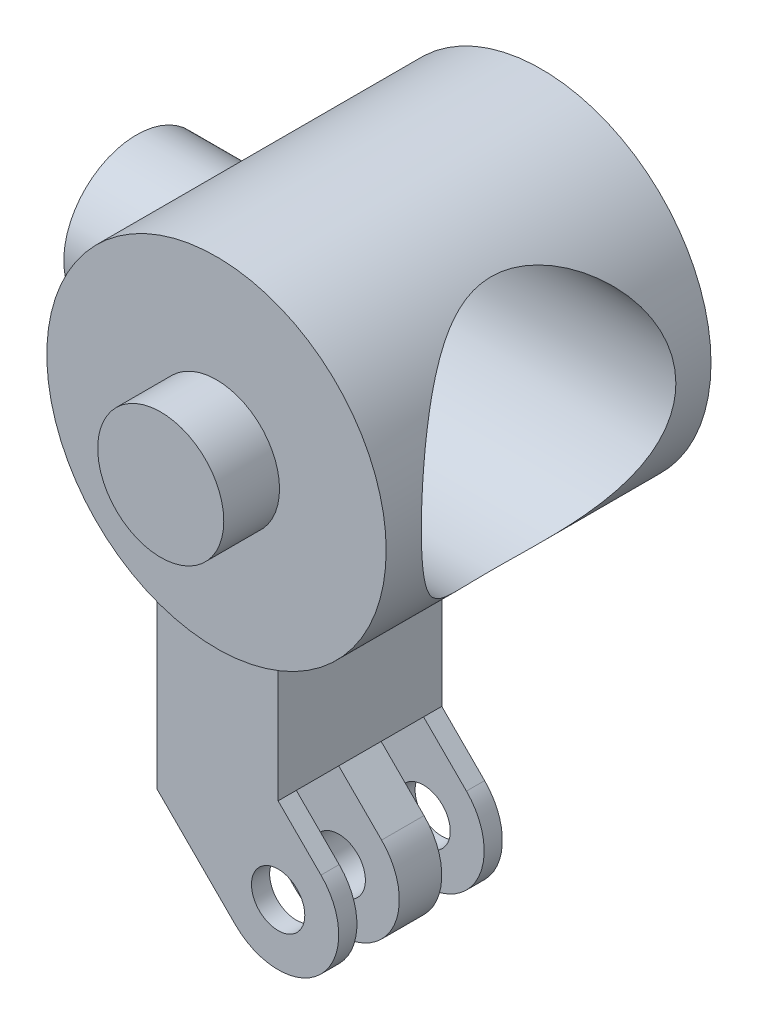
ISO-10303-21;
HEADER;
FILE_DESCRIPTION(('STEP AP214'),'2;1');
FILE_NAME('part.step','',(''),(''),'','','');
FILE_SCHEMA(('AUTOMOTIVE_DESIGN { 1 0 10303 214 1 1 1 1 }'));
ENDSEC;
DATA;
#1=APPLICATION_CONTEXT('core data for automotive mechanical design processes');
#2=APPLICATION_PROTOCOL_DEFINITION('international standard','automotive_design',2000,#1);
#3=PRODUCT_CONTEXT('',#1,'mechanical');
#4=PRODUCT('Part','Part','',(#3));
#5=PRODUCT_RELATED_PRODUCT_CATEGORY('part','',(#4));
#6=PRODUCT_DEFINITION_FORMATION('','',#4);
#7=PRODUCT_DEFINITION_CONTEXT('part definition',#1,'design');
#8=PRODUCT_DEFINITION('design','',#6,#7);
#9=PRODUCT_DEFINITION_SHAPE('','',#8);
#10=(LENGTH_UNIT() NAMED_UNIT(*) SI_UNIT(.MILLI.,.METRE.));
#11=(NAMED_UNIT(*) PLANE_ANGLE_UNIT() SI_UNIT($,.RADIAN.));
#12=(NAMED_UNIT(*) SI_UNIT($,.STERADIAN.) SOLID_ANGLE_UNIT());
#13=UNCERTAINTY_MEASURE_WITH_UNIT(LENGTH_MEASURE(1.E-05),#10,'distance_accuracy_value','');
#14=(GEOMETRIC_REPRESENTATION_CONTEXT(3) GLOBAL_UNCERTAINTY_ASSIGNED_CONTEXT((#13)) GLOBAL_UNIT_ASSIGNED_CONTEXT((#10,
#11,#12)) REPRESENTATION_CONTEXT('',''));
#15=CARTESIAN_POINT('',(0.,0.,0.));
#16=DIRECTION('',(0.,0.,1.));
#17=DIRECTION('',(1.,0.,0.));
#18=AXIS2_PLACEMENT_3D('',#15,#16,#17);
#19=CARTESIAN_POINT('',(-28.5875999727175,51.1546126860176,-23.4989898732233));
#20=DIRECTION('',(0.,0.,1.));
#21=DIRECTION('',(1.,0.,0.));
#22=AXIS2_PLACEMENT_3D('',#19,#20,#21);
#23=CYLINDRICAL_SURFACE('',#22,7.);
#24=CARTESIAN_POINT('',(-21.5875999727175,51.1546126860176,10.25));
#25=CARTESIAN_POINT('',(-21.5876011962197,51.0264088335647,10.2499987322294));
#26=CARTESIAN_POINT('',(-21.591130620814,50.8981728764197,10.2452953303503));
#27=CARTESIAN_POINT('',(-21.605168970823,50.6427134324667,10.2265552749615));
#28=CARTESIAN_POINT('',(-21.6156820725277,50.5154905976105,10.2125130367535));
#29=CARTESIAN_POINT('',(-21.6434657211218,50.2628877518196,10.1752926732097));
#30=CARTESIAN_POINT('',(-21.6607491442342,50.1375117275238,10.1520971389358));
#31=CARTESIAN_POINT('',(-21.7016847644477,49.8897201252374,10.0969274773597));
#32=CARTESIAN_POINT('',(-21.7253398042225,49.7673058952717,10.0649494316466));
#33=CARTESIAN_POINT('',(-21.7783333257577,49.527063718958,9.99291542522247));
#34=CARTESIAN_POINT('',(-21.8076333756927,49.4092108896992,9.95291401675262));
#35=CARTESIAN_POINT('',(-21.8714395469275,49.1778436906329,9.86520416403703));
#36=CARTESIAN_POINT('',(-21.905947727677,49.0643310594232,9.81749267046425));
#37=CARTESIAN_POINT('',(-22.0163020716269,48.7312658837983,9.66364649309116));
#38=CARTESIAN_POINT('',(-22.0990495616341,48.5188731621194,9.54670451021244));
#39=CARTESIAN_POINT('',(-22.2858703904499,48.0974464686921,9.2760694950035));
#40=CARTESIAN_POINT('',(-22.3912089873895,47.890544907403,9.11997600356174));
#41=CARTESIAN_POINT('',(-22.6107695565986,47.5040090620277,8.78175289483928));
#42=CARTESIAN_POINT('',(-22.7250051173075,47.3244177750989,8.59958308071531));
#43=CARTESIAN_POINT('',(-22.908986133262,47.059730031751,8.28906252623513));
#44=CARTESIAN_POINT('',(-22.9783440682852,46.9654717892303,8.16814667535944));
#45=CARTESIAN_POINT('',(-23.1157543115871,46.7875167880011,7.91796964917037));
#46=CARTESIAN_POINT('',(-23.1838062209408,46.7038232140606,7.78870597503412));
#47=CARTESIAN_POINT('',(-23.3164288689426,46.5475257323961,7.52212020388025));
#48=CARTESIAN_POINT('',(-23.3810030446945,46.4749107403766,7.38480635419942));
#49=CARTESIAN_POINT('',(-23.5042350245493,46.341333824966,7.10220995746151));
#50=CARTESIAN_POINT('',(-23.5628961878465,46.2803652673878,6.95693200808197));
#51=CARTESIAN_POINT('',(-23.688398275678,46.1538065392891,6.61178251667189));
#52=CARTESIAN_POINT('',(-23.7520888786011,46.0927000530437,6.40900968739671));
#53=CARTESIAN_POINT('',(-23.8305210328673,46.0192954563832,6.09657119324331));
#54=CARTESIAN_POINT('',(-23.8538061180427,45.9978767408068,5.9911071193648));
#55=CARTESIAN_POINT('',(-23.8938122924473,45.9614352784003,5.77787383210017));
#56=CARTESIAN_POINT('',(-23.9105367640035,45.9464092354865,5.67010583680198));
#57=CARTESIAN_POINT('',(-23.9368035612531,45.9229389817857,5.45193072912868));
#58=CARTESIAN_POINT('',(-23.9462764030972,45.9145584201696,5.3415082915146));
#59=CARTESIAN_POINT('',(-23.9573028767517,45.9048123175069,5.11995649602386));
#60=CARTESIAN_POINT('',(-23.9588567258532,45.9034465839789,5.00882715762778));
#61=CARTESIAN_POINT('',(-23.953959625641,45.9077670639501,4.78684506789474));
#62=CARTESIAN_POINT('',(-23.9475060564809,45.9134555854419,4.67599241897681));
#63=CARTESIAN_POINT('',(-23.9269346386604,45.9317420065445,4.45560524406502));
#64=CARTESIAN_POINT('',(-23.9128167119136,45.9443399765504,4.34607073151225));
#65=CARTESIAN_POINT('',(-23.8637130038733,45.9886922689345,4.04397521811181));
#66=CARTESIAN_POINT('',(-23.8210449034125,46.0277215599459,3.85367609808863));
#67=CARTESIAN_POINT('',(-23.7186077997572,46.1249183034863,3.48291047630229));
#68=CARTESIAN_POINT('',(-23.6588223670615,46.1831041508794,3.30245362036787));
#69=CARTESIAN_POINT('',(-23.5399058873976,46.3041910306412,2.98528134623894));
#70=CARTESIAN_POINT('',(-23.4827354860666,46.3641849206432,2.84668835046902));
#71=CARTESIAN_POINT('',(-23.363204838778,46.4948343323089,2.57689336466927));
#72=CARTESIAN_POINT('',(-23.3008419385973,46.5654953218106,2.44569521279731));
#73=CARTESIAN_POINT('',(-23.172975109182,46.7170803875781,2.19057511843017));
#74=CARTESIAN_POINT('',(-23.1074649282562,46.7980254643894,2.0666688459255));
#75=CARTESIAN_POINT('',(-22.9752694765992,46.969700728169,1.8265487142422));
#76=CARTESIAN_POINT('',(-22.9085843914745,47.0604293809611,1.71033365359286));
#77=CARTESIAN_POINT('',(-22.773958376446,47.253870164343,1.48296566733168));
#78=CARTESIAN_POINT('',(-22.7060279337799,47.356825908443,1.3720130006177));
#79=CARTESIAN_POINT('',(-22.5721726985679,47.5726022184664,1.15881083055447));
#80=CARTESIAN_POINT('',(-22.5062487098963,47.6854266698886,1.05656478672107));
#81=CARTESIAN_POINT('',(-22.3140072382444,48.0379849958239,0.764185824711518));
#82=CARTESIAN_POINT('',(-22.1928024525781,48.2923804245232,0.587730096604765));
#83=CARTESIAN_POINT('',(-21.9977858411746,48.7820270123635,0.310035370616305));
#84=CARTESIAN_POINT('',(-21.9193442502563,49.0108857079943,0.200808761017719));
#85=CARTESIAN_POINT('',(-21.8182195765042,49.3683087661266,0.0615778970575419));
#86=CARTESIAN_POINT('',(-21.7872617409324,49.4898390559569,0.0192613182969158));
#87=CARTESIAN_POINT('',(-21.7314900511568,49.7369483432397,-0.0566203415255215));
#88=CARTESIAN_POINT('',(-21.7066735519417,49.8625255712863,-0.090189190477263));
#89=CARTESIAN_POINT('',(-21.6636006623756,50.117745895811,-0.148266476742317));
#90=CARTESIAN_POINT('',(-21.6453877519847,50.2474100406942,-0.172714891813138));
#91=CARTESIAN_POINT('',(-21.6161921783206,50.5090184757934,-0.211832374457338));
#92=CARTESIAN_POINT('',(-21.6052095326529,50.6409627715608,-0.226501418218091));
#93=CARTESIAN_POINT('',(-21.5907600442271,50.9059514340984,-0.245789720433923));
#94=CARTESIAN_POINT('',(-21.587290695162,51.0389954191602,-0.250412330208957));
#95=CARTESIAN_POINT('',(-21.5879524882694,51.305024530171,-0.24953001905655));
#96=CARTESIAN_POINT('',(-21.5920830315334,51.4380096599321,-0.244025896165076));
#97=CARTESIAN_POINT('',(-21.6070368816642,51.689362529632,-0.224059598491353));
#98=CARTESIAN_POINT('',(-21.6171428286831,51.8078512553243,-0.210557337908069));
#99=CARTESIAN_POINT('',(-21.6431998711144,52.0430445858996,-0.175647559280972));
#100=CARTESIAN_POINT('',(-21.6591529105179,52.1597485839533,-0.15423741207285));
#101=CARTESIAN_POINT('',(-21.6965853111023,52.3905652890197,-0.10380929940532));
#102=CARTESIAN_POINT('',(-21.7180633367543,52.5046786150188,-0.0747931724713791));
#103=CARTESIAN_POINT('',(-21.7661422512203,52.7297259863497,-0.00951773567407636));
#104=CARTESIAN_POINT('',(-21.7927451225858,52.8406587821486,0.0267443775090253));
#105=CARTESIAN_POINT('',(-21.8815843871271,53.175440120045,0.148573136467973));
#106=CARTESIAN_POINT('',(-21.9515212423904,53.3932782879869,0.245419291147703));
#107=CARTESIAN_POINT('',(-22.106762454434,53.8094640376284,0.464613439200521));
#108=CARTESIAN_POINT('',(-22.1920689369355,54.0078089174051,0.586964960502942));
#109=CARTESIAN_POINT('',(-22.388422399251,54.4148862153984,0.876234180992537));
#110=CARTESIAN_POINT('',(-22.501388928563,54.6198216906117,1.04718217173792));
#111=CARTESIAN_POINT('',(-22.7342593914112,55.0001565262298,1.41604839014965));
#112=CARTESIAN_POINT('',(-22.8541783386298,55.1754885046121,1.61402633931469));
#113=CARTESIAN_POINT('',(-23.0438808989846,55.4302737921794,1.94944272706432));
#114=CARTESIAN_POINT('',(-23.1143214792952,55.5198205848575,2.07897278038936));
#115=CARTESIAN_POINT('',(-23.2524168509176,55.6875595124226,2.3467252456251));
#116=CARTESIAN_POINT('',(-23.3200706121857,55.7657474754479,2.48495082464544));
#117=CARTESIAN_POINT('',(-23.4498889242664,55.9099592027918,2.7696273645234));
#118=CARTESIAN_POINT('',(-23.512066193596,55.9760115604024,2.91605790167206));
#119=CARTESIAN_POINT('',(-23.6280696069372,56.0952570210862,3.21709424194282));
#120=CARTESIAN_POINT('',(-23.6819026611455,56.1484607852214,3.37169313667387));
#121=CARTESIAN_POINT('',(-23.7884298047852,56.2511455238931,3.7239145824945));
#122=CARTESIAN_POINT('',(-23.8382376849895,56.2971995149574,3.92348927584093));
#123=CARTESIAN_POINT('',(-23.894830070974,56.3486998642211,4.22887031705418));
#124=CARTESIAN_POINT('',(-23.9106706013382,56.3629335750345,4.33160974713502));
#125=CARTESIAN_POINT('',(-23.9357257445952,56.3853254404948,4.53853335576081));
#126=CARTESIAN_POINT('',(-23.9449433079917,56.393486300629,4.64271686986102));
#127=CARTESIAN_POINT('',(-23.9563699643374,56.4035904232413,4.85233325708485));
#128=CARTESIAN_POINT('',(-23.9585410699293,56.4054999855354,4.95776983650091));
#129=CARTESIAN_POINT('',(-23.955668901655,56.4029665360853,5.16846519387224));
#130=CARTESIAN_POINT('',(-23.9506257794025,56.3985236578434,5.27372397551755));
#131=CARTESIAN_POINT('',(-23.9335516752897,56.3833757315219,5.48330900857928));
#132=CARTESIAN_POINT('',(-23.9215142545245,56.372664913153,5.58763431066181));
#133=CARTESIAN_POINT('',(-23.8909688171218,56.3451882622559,5.79456222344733));
#134=CARTESIAN_POINT('',(-23.8724574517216,56.3284192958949,5.89716391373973));
#135=CARTESIAN_POINT('',(-23.8250310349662,56.2848356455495,6.12211300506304));
#136=CARTESIAN_POINT('',(-23.7947285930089,56.2566289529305,6.24389829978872));
#137=CARTESIAN_POINT('',(-23.7270747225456,56.1922183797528,6.48338359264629));
#138=CARTESIAN_POINT('',(-23.6897179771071,56.1560084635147,6.60108042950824));
#139=CARTESIAN_POINT('',(-23.6093869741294,56.0760566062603,6.83217639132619));
#140=CARTESIAN_POINT('',(-23.5664016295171,56.0322997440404,6.94556644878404));
#141=CARTESIAN_POINT('',(-23.4762720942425,55.9377699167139,7.16759384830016));
#142=CARTESIAN_POINT('',(-23.4291291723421,55.8869990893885,7.27623262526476));
#143=CARTESIAN_POINT('',(-23.3150072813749,55.7599747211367,7.5256599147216));
#144=CARTESIAN_POINT('',(-23.2468243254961,55.6809939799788,7.66451427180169));
#145=CARTESIAN_POINT('',(-23.1076583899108,55.511478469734,7.93351407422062));
#146=CARTESIAN_POINT('',(-23.0366745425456,55.4209401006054,8.06365678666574));
#147=CARTESIAN_POINT('',(-22.8940192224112,55.2286138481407,8.31512987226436));
#148=CARTESIAN_POINT('',(-22.8223472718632,55.1268175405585,8.4364535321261));
#149=CARTESIAN_POINT('',(-22.6802816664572,54.9122905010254,8.66980525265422));
#150=CARTESIAN_POINT('',(-22.6098878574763,54.7995610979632,8.78183443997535));
#151=CARTESIAN_POINT('',(-22.4715431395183,54.5623767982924,8.99693460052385));
#152=CARTESIAN_POINT('',(-22.4036177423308,54.437831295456,9.09992234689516));
#153=CARTESIAN_POINT('',(-22.2725625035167,54.1780973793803,9.29504599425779));
#154=CARTESIAN_POINT('',(-22.2094332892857,54.0429075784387,9.38718047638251));
#155=CARTESIAN_POINT('',(-22.0898061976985,53.7626476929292,9.55934721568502));
#156=CARTESIAN_POINT('',(-22.0332957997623,53.6175971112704,9.63940240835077));
#157=CARTESIAN_POINT('',(-21.9284686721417,53.318195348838,9.78635363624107));
#158=CARTESIAN_POINT('',(-21.8801477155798,53.163849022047,9.85325646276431));
#159=CARTESIAN_POINT('',(-21.8060242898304,52.8934995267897,9.95510849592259));
#160=CARTESIAN_POINT('',(-21.7777725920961,52.779515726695,9.99367609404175));
#161=CARTESIAN_POINT('',(-21.7266721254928,52.5480620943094,10.063139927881));
#162=CARTESIAN_POINT('',(-21.7038220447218,52.4305931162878,10.0940380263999));
#163=CARTESIAN_POINT('',(-21.6640202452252,52.19312456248,10.1476964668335));
#164=CARTESIAN_POINT('',(-21.6470548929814,52.0731315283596,10.1704756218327));
#165=CARTESIAN_POINT('',(-21.619310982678,51.8311909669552,10.207658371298));
#166=CARTESIAN_POINT('',(-21.608529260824,51.7092444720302,10.2220662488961));
#167=CARTESIAN_POINT('',(-21.5965127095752,51.5149978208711,10.2381117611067));
#168=CARTESIAN_POINT('',(-21.5931734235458,51.4430441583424,10.2425668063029));
#169=CARTESIAN_POINT('',(-21.5887165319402,51.2989346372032,10.2485115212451));
#170=CARTESIAN_POINT('',(-21.587599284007,51.2267787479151,10.2500007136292));
#171=CARTESIAN_POINT('',(-21.5875999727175,51.1546126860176,10.25));
#172=B_SPLINE_CURVE_WITH_KNOTS('',3,(#24,#25,#26,#27,#28,#29,#30,#31,#32,#33,#34,#35,#36,#37,
#38,#39,#40,#41,#42,#43,#44,#45,#46,#47,#48,#49,#50,#51,#52,#53,#54,#55,#56,#57,#58,#59,#60,#61,
#62,#63,#64,#65,#66,#67,#68,#69,#70,#71,#72,#73,#74,#75,#76,#77,#78,#79,#80,#81,#82,#83,#84,#85,
#86,#87,#88,#89,#90,#91,#92,#93,#94,#95,#96,#97,#98,#99,#100,#101,#102,#103,#104,#105,#106,#107,
#108,#109,#110,#111,#112,#113,#114,#115,#116,#117,#118,#119,#120,#121,#122,#123,#124,#125,#126,
#127,#128,#129,#130,#131,#132,#133,#134,#135,#136,#137,#138,#139,#140,#141,#142,#143,#144,#145,
#146,#147,#148,#149,#150,#151,#152,#153,#154,#155,#156,#157,#158,#159,#160,#161,#162,#163,#164,
#165,#166,#167,#168,#169,#170,#171),.UNSPECIFIED.,.T.,.F.,(4,2,2,2,2,2,2,2,2,2,2,2,2,2,2,2,2,2,
2,2,2,2,2,2,2,2,2,2,2,2,2,2,2,2,2,2,2,2,2,2,2,2,2,2,2,2,2,2,2,2,2,2,2,2,2,2,2,2,2,2,2,2,2,2,2,2,
2,2,2,2,2,2,2,4),(0.,0.38453366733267,0.769297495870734,1.15479667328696,1.54046812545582,
1.9236011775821,2.306886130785,3.07246235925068,3.90893405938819,4.74670935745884,
5.25106429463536,5.75557091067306,6.25956940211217,6.76327993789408,7.42400799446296,
7.75399907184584,8.08381979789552,8.41676256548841,8.74969619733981,9.08273878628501,
9.4157847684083,10.0100461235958,10.6048797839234,11.0886886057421,11.572746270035,
12.0578087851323,12.5427953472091,13.0399543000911,13.5373098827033,14.529097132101,
15.3219816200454,15.7186301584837,16.1151075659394,16.5141500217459,16.9131934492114,
17.312103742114,17.7109826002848,18.0696141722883,18.4283650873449,18.7870293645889,
19.1458326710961,19.8880454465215,20.6303609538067,21.4966434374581,22.3648718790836,
22.88187214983,23.399061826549,23.9150168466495,24.4305422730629,25.0601070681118,
25.3745481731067,25.6888491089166,26.0048416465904,26.3208275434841,26.6371047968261,
26.9535458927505,27.3388522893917,27.7244502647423,28.1108195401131,28.4970713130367,
29.0174330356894,29.5379572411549,30.0588736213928,30.5797267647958,31.1049585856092,
31.6302589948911,32.154549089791,32.6785677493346,33.0490143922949,33.4193709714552,
33.7888636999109,34.1581672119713,34.3745867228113,34.5910410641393),.UNSPECIFIED.);
#173=CARTESIAN_POINT('',(-21.5875999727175,51.1546126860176,10.25));
#174=VERTEX_POINT('',#173);
#175=EDGE_CURVE('E13',#174,#174,#172,.T.);
#176=ORIENTED_EDGE('',*,*,#175,.F.);
#177=EDGE_LOOP('',(#176));
#178=FACE_BOUND('',#177,.T.);
#179=CARTESIAN_POINT('',(-35.5875999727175,51.1546126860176,2.));
#180=CARTESIAN_POINT('',(-35.5875940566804,51.3148944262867,2.00000746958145));
#181=CARTESIAN_POINT('',(-35.5820324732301,51.47544659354,2.01292131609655));
#182=CARTESIAN_POINT('',(-35.5603391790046,51.7919620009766,2.06408236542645));
#183=CARTESIAN_POINT('',(-35.5441807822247,51.9479126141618,2.10239352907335));
#184=CARTESIAN_POINT('',(-35.5030162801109,52.2501473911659,2.20266976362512));
#185=CARTESIAN_POINT('',(-35.4780408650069,52.3964630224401,2.2645528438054));
#186=CARTESIAN_POINT('',(-35.4216565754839,52.6764860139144,2.40986441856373));
#187=CARTESIAN_POINT('',(-35.3902494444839,52.8101967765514,2.4932870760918));
#188=CARTESIAN_POINT('',(-35.3222781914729,53.068454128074,2.68392764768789));
#189=CARTESIAN_POINT('',(-35.2855389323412,53.1922531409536,2.79209525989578));
#190=CARTESIAN_POINT('',(-35.2117765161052,53.4206030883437,3.02714386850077));
#191=CARTESIAN_POINT('',(-35.1747532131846,53.5251433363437,3.15403518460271));
#192=CARTESIAN_POINT('',(-35.1024205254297,53.7174695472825,3.4310327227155));
#193=CARTESIAN_POINT('',(-35.0673045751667,53.804080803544,3.5820104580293));
#194=CARTESIAN_POINT('',(-35.0055616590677,53.9503446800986,3.89810942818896));
#195=CARTESIAN_POINT('',(-34.9789300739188,54.0100119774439,4.06322290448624));
#196=CARTESIAN_POINT('',(-34.9390779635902,54.0975618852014,4.39430073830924));
#197=CARTESIAN_POINT('',(-34.9252521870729,54.1268876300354,4.55980770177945));
#198=CARTESIAN_POINT('',(-34.9108484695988,54.1574187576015,4.89392596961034));
#199=CARTESIAN_POINT('',(-34.9102625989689,54.1586409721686,5.06253535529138));
#200=CARTESIAN_POINT('',(-34.9218957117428,54.1340126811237,5.38329990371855));
#201=CARTESIAN_POINT('',(-34.933068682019,54.1103738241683,5.53567062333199));
#202=CARTESIAN_POINT('',(-34.9651840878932,54.0404204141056,5.83402758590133));
#203=CARTESIAN_POINT('',(-34.9861285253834,53.994101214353,5.98001251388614));
#204=CARTESIAN_POINT('',(-35.0359068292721,53.8791892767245,6.26524715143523));
#205=CARTESIAN_POINT('',(-35.0649029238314,53.8101324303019,6.40428029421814));
#206=CARTESIAN_POINT('',(-35.1274849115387,53.6520357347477,6.66934632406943));
#207=CARTESIAN_POINT('',(-35.1610726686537,53.5629877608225,6.79537389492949));
#208=CARTESIAN_POINT('',(-35.2327240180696,53.3580467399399,7.04277750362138));
#209=CARTESIAN_POINT('',(-35.2709185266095,53.2404599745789,7.16271672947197));
#210=CARTESIAN_POINT('',(-35.3449460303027,52.9864860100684,7.38167159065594));
#211=CARTESIAN_POINT('',(-35.380778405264,52.8500939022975,7.48068174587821));
#212=CARTESIAN_POINT('',(-35.4471969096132,52.5577985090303,7.65724393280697));
#213=CARTESIAN_POINT('',(-35.4776245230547,52.4014838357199,7.73417901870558));
#214=CARTESIAN_POINT('',(-35.528573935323,52.0764923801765,7.86015023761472));
#215=CARTESIAN_POINT('',(-35.5491015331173,51.9078229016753,7.9092027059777));
#216=CARTESIAN_POINT('',(-35.5768352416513,51.574888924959,7.97493386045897));
#217=CARTESIAN_POINT('',(-35.5848324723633,51.4110706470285,7.99353876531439));
#218=CARTESIAN_POINT('',(-35.5891541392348,51.0824693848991,8.00362957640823));
#219=CARTESIAN_POINT('',(-35.5854821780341,50.9176867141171,7.99512385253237));
#220=CARTESIAN_POINT('',(-35.567386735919,50.6010702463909,7.95258436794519));
#221=CARTESIAN_POINT('',(-35.5535451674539,50.4490137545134,7.91993167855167));
#222=CARTESIAN_POINT('',(-35.5171388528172,50.1527215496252,7.83197910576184));
#223=CARTESIAN_POINT('',(-35.4945730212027,50.0084868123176,7.77667640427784));
#224=CARTESIAN_POINT('',(-35.4419874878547,49.7268357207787,7.64319884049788));
#225=CARTESIAN_POINT('',(-35.4117570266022,49.5897729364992,7.56436366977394));
#226=CARTESIAN_POINT('',(-35.3470298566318,49.3303277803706,7.38678105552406));
#227=CARTESIAN_POINT('',(-35.312531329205,49.2079517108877,7.28802511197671));
#228=CARTESIAN_POINT('',(-35.2397478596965,48.9716450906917,7.06471041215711));
#229=CARTESIAN_POINT('',(-35.2013735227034,48.8590465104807,6.93876778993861));
#230=CARTESIAN_POINT('',(-35.12744034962,48.6561783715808,6.66921770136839));
#231=CARTESIAN_POINT('',(-35.0918822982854,48.5659150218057,6.52560533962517));
#232=CARTESIAN_POINT('',(-35.0272296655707,48.4089739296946,6.22118614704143));
#233=CARTESIAN_POINT('',(-34.9982625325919,48.3427485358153,6.06011699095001));
#234=CARTESIAN_POINT('',(-34.9517360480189,48.2389538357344,5.72747367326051));
#235=CARTESIAN_POINT('',(-34.9341665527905,48.2013590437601,5.55590900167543));
#236=CARTESIAN_POINT('',(-34.9140347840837,48.1584932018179,5.22200882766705));
#237=CARTESIAN_POINT('',(-34.9103792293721,48.1508657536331,5.06004073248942));
#238=CARTESIAN_POINT('',(-34.9155561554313,48.1617861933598,4.73721025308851));
#239=CARTESIAN_POINT('',(-34.9243864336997,48.1803294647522,4.57634767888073));
#240=CARTESIAN_POINT('',(-34.9525165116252,48.2410483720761,4.26895830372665));
#241=CARTESIAN_POINT('',(-34.9712471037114,48.2819429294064,4.12212120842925));
#242=CARTESIAN_POINT('',(-35.0165887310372,48.3849104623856,3.83737923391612));
#243=CARTESIAN_POINT('',(-35.0432020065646,48.446989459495,3.69947690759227));
#244=CARTESIAN_POINT('',(-35.1033524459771,48.5949801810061,3.42717929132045));
#245=CARTESIAN_POINT('',(-35.1372164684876,48.6821303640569,3.29353084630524));
#246=CARTESIAN_POINT('',(-35.2071977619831,48.8761166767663,3.04201763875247));
#247=CARTESIAN_POINT('',(-35.2433158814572,48.9829602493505,2.92415887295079));
#248=CARTESIAN_POINT('',(-35.3171542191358,49.2232621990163,2.69799636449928));
#249=CARTESIAN_POINT('',(-35.3547759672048,49.3581554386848,2.59118043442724));
#250=CARTESIAN_POINT('',(-35.4245647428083,49.6454150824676,2.40156023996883));
#251=CARTESIAN_POINT('',(-35.4567292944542,49.7977893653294,2.31876686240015));
#252=CARTESIAN_POINT('',(-35.4979543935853,50.0350673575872,2.21540730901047));
#253=CARTESIAN_POINT('',(-35.510463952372,50.1150398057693,2.18456670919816));
#254=CARTESIAN_POINT('',(-35.5329319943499,50.2776418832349,2.12976179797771));
#255=CARTESIAN_POINT('',(-35.5428916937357,50.3602702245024,2.10579420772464));
#256=CARTESIAN_POINT('',(-35.559943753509,50.5273471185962,2.06505228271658));
#257=CARTESIAN_POINT('',(-35.5670431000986,50.6117906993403,2.04826041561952));
#258=CARTESIAN_POINT('',(-35.5781931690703,50.7819647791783,2.02199128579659));
#259=CARTESIAN_POINT('',(-35.5822460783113,50.8676943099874,2.0125087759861));
#260=CARTESIAN_POINT('',(-35.5856758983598,50.9871200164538,2.00449172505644));
#261=CARTESIAN_POINT('',(-35.5863967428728,51.0205915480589,2.00280814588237));
#262=CARTESIAN_POINT('',(-35.5873594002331,51.0875756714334,2.00056149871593));
#263=CARTESIAN_POINT('',(-35.5876012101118,51.1210882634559,1.99999843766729));
#264=CARTESIAN_POINT('',(-35.5875999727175,51.1546126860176,2.));
#265=B_SPLINE_CURVE_WITH_KNOTS('',3,(#179,#180,#181,#182,#183,#184,#185,#186,#187,#188,#189,
#190,#191,#192,#193,#194,#195,#196,#197,#198,#199,#200,#201,#202,#203,#204,#205,#206,#207,#208,
#209,#210,#211,#212,#213,#214,#215,#216,#217,#218,#219,#220,#221,#222,#223,#224,#225,#226,#227,
#228,#229,#230,#231,#232,#233,#234,#235,#236,#237,#238,#239,#240,#241,#242,#243,#244,#245,#246,
#247,#248,#249,#250,#251,#252,#253,#254,#255,#256,#257,#258,#259,#260,#261,#262,#263,#264),
.UNSPECIFIED.,.T.,.F.,(4,2,2,2,2,2,2,2,2,2,2,2,2,2,2,2,2,2,2,2,2,2,2,2,2,2,2,2,2,2,2,2,2,2,2,2,
2,2,2,2,2,2,4),(0.,0.480714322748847,0.962643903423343,1.44291226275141,1.92305060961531,
2.42622743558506,2.92968263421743,3.45969560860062,3.98941952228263,4.492594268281,
4.99546764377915,5.45710720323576,5.91884138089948,6.3906540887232,6.86265889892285,
7.3770983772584,7.89167239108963,8.41947244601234,8.94696296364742,9.43957347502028,
9.93203191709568,10.3983119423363,10.8646499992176,11.3455505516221,11.8266567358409,
12.3440285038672,12.8615439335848,13.3883469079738,13.9146803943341,14.3986848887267,
14.882604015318,15.341320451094,15.8001673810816,16.2874475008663,16.7749121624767,
17.3008416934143,17.8270092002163,18.0865840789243,18.3460349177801,18.6048481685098,
18.8634754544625,18.964020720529,19.0645666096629),.UNSPECIFIED.);
#266=CARTESIAN_POINT('',(-35.5875999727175,51.1546126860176,2.));
#267=VERTEX_POINT('',#266);
#268=EDGE_CURVE('E279',#267,#267,#265,.T.);
#269=ORIENTED_EDGE('',*,*,#268,.T.);
#270=EDGE_LOOP('',(#269));
#271=FACE_BOUND('',#270,.T.);
#272=CARTESIAN_POINT('',(-28.5875999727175,51.1546126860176,-1.7));
#273=DIRECTION('',(0.,0.,-1.));
#274=DIRECTION('',(-1.,0.,0.));
#275=AXIS2_PLACEMENT_3D('',#272,#273,#274);
#276=CIRCLE('',#275,7.);
#277=CARTESIAN_POINT('',(-35.5875999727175,51.1546126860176,-1.7));
#278=VERTEX_POINT('',#277);
#279=EDGE_CURVE('E274',#278,#278,#276,.F.);
#280=ORIENTED_EDGE('',*,*,#279,.T.);
#281=EDGE_LOOP('',(#280));
#282=FACE_BOUND('',#281,.T.);
#283=CARTESIAN_POINT('',(-28.5875999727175,51.1546126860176,11.7));
#284=DIRECTION('',(0.,0.,1.));
#285=DIRECTION('',(1.,0.,0.));
#286=AXIS2_PLACEMENT_3D('',#283,#284,#285);
#287=CIRCLE('',#286,7.);
#288=CARTESIAN_POINT('',(-21.5875999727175,51.1546126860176,11.7));
#289=VERTEX_POINT('',#288);
#290=EDGE_CURVE('E271',#289,#289,#287,.T.);
#291=ORIENTED_EDGE('',*,*,#290,.F.);
#292=EDGE_LOOP('',(#291));
#293=FACE_BOUND('',#292,.T.);
#294=CARTESIAN_POINT('',(-28.5875999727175,51.1546126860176,2.40757331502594));
#295=DIRECTION('',(0.,0.,1.));
#296=DIRECTION('',(-1.,0.,0.));
#297=AXIS2_PLACEMENT_3D('',#294,#295,#296);
#298=CIRCLE('',#297,7.);
#299=CARTESIAN_POINT('',(-33.5875999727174,46.2556332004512,2.40757331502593));
#300=VERTEX_POINT('',#299);
#301=CARTESIAN_POINT('',(-28.5875999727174,44.1546126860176,2.40757331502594));
#302=VERTEX_POINT('',#301);
#303=EDGE_CURVE('E398',#300,#302,#298,.T.);
#304=ORIENTED_EDGE('',*,*,#303,.F.);
#305=DIRECTION('',(0.,0.,1.));
#306=VECTOR('',#305,1.);
#307=CARTESIAN_POINT('',(-33.5875999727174,46.2556332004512,-23.4989898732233));
#308=LINE('',#307,#306);
#309=CARTESIAN_POINT('',(-33.5875999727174,46.2556332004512,9.15757331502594));
#310=VERTEX_POINT('',#309);
#311=EDGE_CURVE('E54',#310,#300,#308,.F.);
#312=ORIENTED_EDGE('',*,*,#311,.F.);
#313=CARTESIAN_POINT('',(-28.5875999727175,51.1546126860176,9.15757331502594));
#314=DIRECTION('',(0.,0.,-1.));
#315=DIRECTION('',(1.,0.,0.));
#316=AXIS2_PLACEMENT_3D('',#313,#314,#315);
#317=CIRCLE('',#316,7.);
#318=CARTESIAN_POINT('',(-28.5875999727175,44.1546126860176,9.15757331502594));
#319=VERTEX_POINT('',#318);
#320=EDGE_CURVE('E201',#319,#310,#317,.T.);
#321=ORIENTED_EDGE('',*,*,#320,.F.);
#322=DIRECTION('',(0.,0.,1.));
#323=VECTOR('',#322,1.);
#324=CARTESIAN_POINT('',(-28.5875999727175,44.1546126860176,-23.4989898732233));
#325=LINE('',#324,#323);
#326=EDGE_CURVE('E61',#302,#319,#325,.T.);
#327=ORIENTED_EDGE('',*,*,#326,.F.);
#328=EDGE_LOOP('',(#304,#312,#321,#327));
#329=FACE_BOUND('',#328,.T.);
#330=ADVANCED_FACE('F38',(#178,#271,#282,#293,#329),#23,.T.);
#331=CARTESIAN_POINT('',(-28.5875999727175,51.1546126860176,4.90757331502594));
#332=DIRECTION('',(0.,0.,-1.));
#333=DIRECTION('',(-1.,0.,0.));
#334=AXIS2_PLACEMENT_3D('',#331,#332,#333);
#335=PLANE('',#334);
#336=CARTESIAN_POINT('',(-28.5875999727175,33.903098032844,4.90757331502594));
#337=DIRECTION('',(0.,0.,-1.));
#338=DIRECTION('',(-1.,0.,0.));
#339=AXIS2_PLACEMENT_3D('',#336,#337,#338);
#340=CIRCLE('',#339,1.09999999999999);
#341=CARTESIAN_POINT('',(-29.6875999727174,33.903098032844,4.90757331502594));
#342=VERTEX_POINT('',#341);
#343=EDGE_CURVE('E250',#342,#342,#340,.T.);
#344=ORIENTED_EDGE('',*,*,#343,.F.);
#345=EDGE_LOOP('',(#344));
#346=FACE_BOUND('',#345,.T.);
#347=DIRECTION('',(-0.707106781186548,0.707106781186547,0.));
#348=VECTOR('',#347,1.);
#349=CARTESIAN_POINT('',(-30.3553669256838,32.1353310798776,4.90757331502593));
#350=LINE('',#349,#348);
#351=CARTESIAN_POINT('',(-30.3553669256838,32.1353310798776,4.90757331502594));
#352=VERTEX_POINT('',#351);
#353=CARTESIAN_POINT('',(-33.5875999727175,35.3675641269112,4.90757331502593));
#354=VERTEX_POINT('',#353);
#355=EDGE_CURVE('E259',#352,#354,#350,.T.);
#356=ORIENTED_EDGE('',*,*,#355,.T.);
#357=DIRECTION('',(-0.923879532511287,-0.382683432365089,0.));
#358=VECTOR('',#357,1.);
#359=CARTESIAN_POINT('',(-28.5875999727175,37.4386319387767,4.90757331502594));
#360=LINE('',#359,#358);
#361=CARTESIAN_POINT('',(-28.5875999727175,37.4386319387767,4.90757331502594));
#362=VERTEX_POINT('',#361);
#363=EDGE_CURVE('E168',#362,#354,#360,.T.);
#364=ORIENTED_EDGE('',*,*,#363,.F.);
#365=DIRECTION('',(0.707106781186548,-0.707106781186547,0.));
#366=VECTOR('',#365,1.);
#367=CARTESIAN_POINT('',(-28.5875999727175,37.4386319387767,4.90757331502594));
#368=LINE('',#367,#366);
#369=CARTESIAN_POINT('',(-26.8198330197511,35.6708649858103,4.90757331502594));
#370=VERTEX_POINT('',#369);
#371=EDGE_CURVE('E253',#362,#370,#368,.T.);
#372=ORIENTED_EDGE('',*,*,#371,.T.);
#373=CARTESIAN_POINT('',(-28.5875999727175,33.903098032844,4.90757331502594));
#374=DIRECTION('',(0.,0.,-1.));
#375=DIRECTION('',(-1.,0.,0.));
#376=AXIS2_PLACEMENT_3D('',#373,#374,#375);
#377=CIRCLE('',#376,2.5);
#378=EDGE_CURVE('E256',#370,#352,#377,.T.);
#379=ORIENTED_EDGE('',*,*,#378,.T.);
#380=EDGE_LOOP('',(#356,#364,#372,#379));
#381=FACE_BOUND('',#380,.T.);
#382=ADVANCED_FACE('F295',(#346,#381),#335,.T.);
#383=CARTESIAN_POINT('',(-28.5875999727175,51.1546126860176,6.65757331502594));
#384=DIRECTION('',(0.,0.,1.));
#385=DIRECTION('',(1.,0.,0.));
#386=AXIS2_PLACEMENT_3D('',#383,#384,#385);
#387=PLANE('',#386);
#388=CARTESIAN_POINT('',(-28.5875999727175,33.903098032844,6.65757331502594));
#389=DIRECTION('',(0.,0.,1.));
#390=DIRECTION('',(1.,0.,0.));
#391=AXIS2_PLACEMENT_3D('',#388,#389,#390);
#392=CIRCLE('',#391,1.09999999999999);
#393=CARTESIAN_POINT('',(-27.4875999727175,33.903098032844,6.65757331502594));
#394=VERTEX_POINT('',#393);
#395=EDGE_CURVE('E241',#394,#394,#392,.T.);
#396=ORIENTED_EDGE('',*,*,#395,.F.);
#397=EDGE_LOOP('',(#396));
#398=FACE_BOUND('',#397,.T.);
#399=DIRECTION('',(-0.707106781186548,0.707106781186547,0.));
#400=VECTOR('',#399,1.);
#401=CARTESIAN_POINT('',(-26.8198330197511,35.6708649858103,6.65757331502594));
#402=LINE('',#401,#400);
#403=CARTESIAN_POINT('',(-26.8198330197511,35.6708649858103,6.65757331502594));
#404=VERTEX_POINT('',#403);
#405=CARTESIAN_POINT('',(-28.5875999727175,37.4386319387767,6.65757331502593));
#406=VERTEX_POINT('',#405);
#407=EDGE_CURVE('E248',#404,#406,#402,.T.);
#408=ORIENTED_EDGE('',*,*,#407,.T.);
#409=DIRECTION('',(0.923879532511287,0.382683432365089,0.));
#410=VECTOR('',#409,1.);
#411=CARTESIAN_POINT('',(-33.5875999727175,35.3675641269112,6.65757331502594));
#412=LINE('',#411,#410);
#413=CARTESIAN_POINT('',(-33.5875999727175,35.3675641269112,6.65757331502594));
#414=VERTEX_POINT('',#413);
#415=EDGE_CURVE('E226',#414,#406,#412,.T.);
#416=ORIENTED_EDGE('',*,*,#415,.F.);
#417=DIRECTION('',(0.707106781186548,-0.707106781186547,0.));
#418=VECTOR('',#417,1.);
#419=CARTESIAN_POINT('',(-33.5875999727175,35.3675641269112,6.65757331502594));
#420=LINE('',#419,#418);
#421=CARTESIAN_POINT('',(-30.3553669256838,32.1353310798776,6.65757331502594));
#422=VERTEX_POINT('',#421);
#423=EDGE_CURVE('E244',#414,#422,#420,.T.);
#424=ORIENTED_EDGE('',*,*,#423,.T.);
#425=CARTESIAN_POINT('',(-28.5875999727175,33.903098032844,6.65757331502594));
#426=DIRECTION('',(0.,0.,1.));
#427=DIRECTION('',(1.,0.,0.));
#428=AXIS2_PLACEMENT_3D('',#425,#426,#427);
#429=CIRCLE('',#428,2.5);
#430=EDGE_CURVE('E246',#422,#404,#429,.T.);
#431=ORIENTED_EDGE('',*,*,#430,.T.);
#432=EDGE_LOOP('',(#408,#416,#424,#431));
#433=FACE_BOUND('',#432,.T.);
#434=ADVANCED_FACE('F327',(#398,#433),#387,.T.);
#435=CARTESIAN_POINT('',(-28.5875999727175,33.903098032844,3.79630347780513));
#436=DIRECTION('',(0.,0.,1.));
#437=DIRECTION('',(1.,0.,0.));
#438=AXIS2_PLACEMENT_3D('',#435,#436,#437);
#439=CYLINDRICAL_SURFACE('',#438,1.1);
#440=ORIENTED_EDGE('',*,*,#343,.T.);
#441=EDGE_LOOP('',(#440));
#442=FACE_BOUND('',#441,.T.);
#443=ORIENTED_EDGE('',*,*,#395,.T.);
#444=EDGE_LOOP('',(#443));
#445=FACE_BOUND('',#444,.T.);
#446=ADVANCED_FACE('F331',(#442,#445),#439,.F.);
#447=CARTESIAN_POINT('',(-26.8198330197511,35.6708649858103,-2.71935088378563));
#448=DIRECTION('',(0.707106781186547,0.707106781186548,0.));
#449=DIRECTION('',(-0.707106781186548,0.707106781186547,0.));
#450=AXIS2_PLACEMENT_3D('',#447,#448,#449);
#451=PLANE('',#450);
#452=DIRECTION('',(0.,0.,1.));
#453=VECTOR('',#452,1.);
#454=CARTESIAN_POINT('',(-28.5875999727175,37.4386319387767,-2.71935088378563));
#455=LINE('',#454,#453);
#456=EDGE_CURVE('E424',#362,#406,#455,.T.);
#457=ORIENTED_EDGE('',*,*,#456,.T.);
#458=ORIENTED_EDGE('',*,*,#407,.F.);
#459=DIRECTION('',(0.,0.,1.));
#460=VECTOR('',#459,1.);
#461=CARTESIAN_POINT('',(-26.8198330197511,35.6708649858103,-2.71935088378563));
#462=LINE('',#461,#460);
#463=EDGE_CURVE('E443',#370,#404,#462,.T.);
#464=ORIENTED_EDGE('',*,*,#463,.F.);
#465=ORIENTED_EDGE('',*,*,#371,.F.);
#466=EDGE_LOOP('',(#457,#458,#464,#465));
#467=FACE_BOUND('',#466,.T.);
#468=ADVANCED_FACE('F490',(#467),#451,.T.);
#469=CARTESIAN_POINT('',(-28.5875999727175,33.903098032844,-2.71935088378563));
#470=DIRECTION('',(0.,0.,1.));
#471=DIRECTION('',(1.,0.,0.));
#472=AXIS2_PLACEMENT_3D('',#469,#470,#471);
#473=CYLINDRICAL_SURFACE('',#472,2.5);
#474=ORIENTED_EDGE('',*,*,#463,.T.);
#475=ORIENTED_EDGE('',*,*,#430,.F.);
#476=DIRECTION('',(0.,0.,1.));
#477=VECTOR('',#476,1.);
#478=CARTESIAN_POINT('',(-30.3553669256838,32.1353310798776,1.4505144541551));
#479=LINE('',#478,#477);
#480=EDGE_CURVE('E437',#352,#422,#479,.T.);
#481=ORIENTED_EDGE('',*,*,#480,.F.);
#482=ORIENTED_EDGE('',*,*,#378,.F.);
#483=EDGE_LOOP('',(#474,#475,#481,#482));
#484=FACE_BOUND('',#483,.T.);
#485=ADVANCED_FACE('F486',(#484),#473,.T.);
#486=CARTESIAN_POINT('',(-33.5875999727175,35.3675641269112,1.4505144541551));
#487=DIRECTION('',(0.707106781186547,0.707106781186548,0.));
#488=DIRECTION('',(-0.707106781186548,0.707106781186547,0.));
#489=AXIS2_PLACEMENT_3D('',#486,#487,#488);
#490=PLANE('',#489);
#491=ORIENTED_EDGE('',*,*,#423,.F.);
#492=DIRECTION('',(0.,0.,1.));
#493=VECTOR('',#492,1.);
#494=CARTESIAN_POINT('',(-33.5875999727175,35.3675641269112,1.4505144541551));
#495=LINE('',#494,#493);
#496=EDGE_CURVE('E433',#354,#414,#495,.T.);
#497=ORIENTED_EDGE('',*,*,#496,.F.);
#498=ORIENTED_EDGE('',*,*,#355,.F.);
#499=ORIENTED_EDGE('',*,*,#480,.T.);
#500=EDGE_LOOP('',(#491,#497,#498,#499));
#501=FACE_BOUND('',#500,.T.);
#502=ADVANCED_FACE('F481',(#501),#490,.F.);
#503=CARTESIAN_POINT('',(-33.5875999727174,51.1546126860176,5.));
#504=DIRECTION('',(1.,0.,0.));
#505=DIRECTION('',(0.,0.,-1.));
#506=AXIS2_PLACEMENT_3D('',#503,#504,#505);
#507=PLANE('',#506);
#508=ORIENTED_EDGE('',*,*,#496,.T.);
#509=DIRECTION('',(0.,0.,-1.));
#510=VECTOR('',#509,1.);
#511=CARTESIAN_POINT('',(-33.5875999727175,35.3675641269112,8.40757331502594));
#512=LINE('',#511,#510);
#513=CARTESIAN_POINT('',(-33.5875999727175,35.3675641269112,8.40757331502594));
#514=VERTEX_POINT('',#513);
#515=EDGE_CURVE('E235',#514,#414,#512,.T.);
#516=ORIENTED_EDGE('',*,*,#515,.F.);
#517=DIRECTION('',(0.,0.,-1.));
#518=VECTOR('',#517,1.);
#519=CARTESIAN_POINT('',(-33.5875999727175,35.3675641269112,9.15757331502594));
#520=LINE('',#519,#518);
#521=CARTESIAN_POINT('',(-33.5875999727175,35.3675641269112,9.15757331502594));
#522=VERTEX_POINT('',#521);
#523=EDGE_CURVE('E217',#522,#514,#520,.T.);
#524=ORIENTED_EDGE('',*,*,#523,.F.);
#525=DIRECTION('',(0.,-1.,0.));
#526=VECTOR('',#525,1.);
#527=CARTESIAN_POINT('',(-33.5875999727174,46.2556332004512,9.15757331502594));
#528=LINE('',#527,#526);
#529=EDGE_CURVE('E204',#310,#522,#528,.T.);
#530=ORIENTED_EDGE('',*,*,#529,.F.);
#531=ORIENTED_EDGE('',*,*,#311,.T.);
#532=DIRECTION('',(0.,1.,0.));
#533=VECTOR('',#532,1.);
#534=CARTESIAN_POINT('',(-33.5875999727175,35.3675641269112,2.40757331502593));
#535=LINE('',#534,#533);
#536=CARTESIAN_POINT('',(-33.5875999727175,35.3675641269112,2.40757331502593));
#537=VERTEX_POINT('',#536);
#538=EDGE_CURVE('E152',#537,#300,#535,.T.);
#539=ORIENTED_EDGE('',*,*,#538,.F.);
#540=DIRECTION('',(0.,0.,1.));
#541=VECTOR('',#540,1.);
#542=CARTESIAN_POINT('',(-33.5875999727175,35.3675641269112,2.40757331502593));
#543=LINE('',#542,#541);
#544=CARTESIAN_POINT('',(-33.5875999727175,35.3675641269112,3.15757331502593));
#545=VERTEX_POINT('',#544);
#546=EDGE_CURVE('E149',#537,#545,#543,.T.);
#547=ORIENTED_EDGE('',*,*,#546,.T.);
#548=DIRECTION('',(0.,0.,1.));
#549=VECTOR('',#548,1.);
#550=CARTESIAN_POINT('',(-33.5875999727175,35.3675641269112,3.15757331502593));
#551=LINE('',#550,#549);
#552=EDGE_CURVE('E178',#545,#354,#551,.T.);
#553=ORIENTED_EDGE('',*,*,#552,.T.);
#554=EDGE_LOOP('',(#508,#516,#524,#530,#531,#539,#547,#553));
#555=FACE_BOUND('',#554,.T.);
#556=ADVANCED_FACE('F416',(#555),#507,.F.);
#557=CARTESIAN_POINT('',(-28.5875999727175,56.1546126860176,10.));
#558=DIRECTION('',(-1.,0.,0.));
#559=DIRECTION('',(0.,0.,1.));
#560=AXIS2_PLACEMENT_3D('',#557,#558,#559);
#561=PLANE('',#560);
#562=ORIENTED_EDGE('',*,*,#326,.T.);
#563=DIRECTION('',(0.,1.,0.));
#564=VECTOR('',#563,1.);
#565=CARTESIAN_POINT('',(-28.5875999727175,37.4386319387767,9.15757331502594));
#566=LINE('',#565,#564);
#567=CARTESIAN_POINT('',(-28.5875999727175,37.4386319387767,9.15757331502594));
#568=VERTEX_POINT('',#567);
#569=EDGE_CURVE('E198',#568,#319,#566,.T.);
#570=ORIENTED_EDGE('',*,*,#569,.F.);
#571=DIRECTION('',(0.,0.,-1.));
#572=VECTOR('',#571,1.);
#573=CARTESIAN_POINT('',(-28.5875999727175,37.4386319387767,9.15757331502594));
#574=LINE('',#573,#572);
#575=CARTESIAN_POINT('',(-28.5875999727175,37.4386319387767,8.40757331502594));
#576=VERTEX_POINT('',#575);
#577=EDGE_CURVE('E220',#568,#576,#574,.T.);
#578=ORIENTED_EDGE('',*,*,#577,.T.);
#579=DIRECTION('',(0.,0.,-1.));
#580=VECTOR('',#579,1.);
#581=CARTESIAN_POINT('',(-28.5875999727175,37.4386319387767,8.40757331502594));
#582=LINE('',#581,#580);
#583=EDGE_CURVE('E230',#576,#406,#582,.T.);
#584=ORIENTED_EDGE('',*,*,#583,.T.);
#585=ORIENTED_EDGE('',*,*,#456,.F.);
#586=DIRECTION('',(0.,0.,1.));
#587=VECTOR('',#586,1.);
#588=CARTESIAN_POINT('',(-28.5875999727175,37.4386319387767,3.15757331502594));
#589=LINE('',#588,#587);
#590=CARTESIAN_POINT('',(-28.5875999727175,37.4386319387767,3.15757331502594));
#591=VERTEX_POINT('',#590);
#592=EDGE_CURVE('E182',#591,#362,#589,.T.);
#593=ORIENTED_EDGE('',*,*,#592,.F.);
#594=DIRECTION('',(0.,0.,1.));
#595=VECTOR('',#594,1.);
#596=CARTESIAN_POINT('',(-28.5875999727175,37.4386319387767,2.40757331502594));
#597=LINE('',#596,#595);
#598=CARTESIAN_POINT('',(-28.5875999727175,37.4386319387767,2.40757331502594));
#599=VERTEX_POINT('',#598);
#600=EDGE_CURVE('E173',#599,#591,#597,.T.);
#601=ORIENTED_EDGE('',*,*,#600,.F.);
#602=DIRECTION('',(0.,-1.,0.));
#603=VECTOR('',#602,1.);
#604=CARTESIAN_POINT('',(-28.5875999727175,44.1546126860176,2.40757331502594));
#605=LINE('',#604,#603);
#606=EDGE_CURVE('E400',#302,#599,#605,.T.);
#607=ORIENTED_EDGE('',*,*,#606,.F.);
#608=EDGE_LOOP('',(#562,#570,#578,#584,#585,#593,#601,#607));
#609=FACE_BOUND('',#608,.T.);
#610=ADVANCED_FACE('F40',(#609),#561,.F.);
#611=CARTESIAN_POINT('',(-28.5875999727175,51.1546126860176,16.6381900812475));
#612=DIRECTION('',(0.,0.,1.));
#613=DIRECTION('',(1.,0.,0.));
#614=AXIS2_PLACEMENT_3D('',#611,#612,#613);
#615=CYLINDRICAL_SURFACE('',#614,2.60000000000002);
#616=CARTESIAN_POINT('',(-28.5875999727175,51.1546126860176,-1.7));
#617=DIRECTION('',(0.,0.,-1.));
#618=DIRECTION('',(-1.,0.,0.));
#619=AXIS2_PLACEMENT_3D('',#616,#617,#618);
#620=CIRCLE('',#619,2.60000000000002);
#621=CARTESIAN_POINT('',(-31.1875999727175,51.1546126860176,-1.7));
#622=VERTEX_POINT('',#621);
#623=EDGE_CURVE('E47',#622,#622,#620,.F.);
#624=ORIENTED_EDGE('',*,*,#623,.F.);
#625=EDGE_LOOP('',(#624));
#626=FACE_BOUND('',#625,.T.);
#627=CARTESIAN_POINT('',(-28.5875999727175,51.1546126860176,-4.));
#628=DIRECTION('',(0.,0.,-1.));
#629=DIRECTION('',(-1.,0.,0.));
#630=AXIS2_PLACEMENT_3D('',#627,#628,#629);
#631=CIRCLE('',#630,2.60000000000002);
#632=CARTESIAN_POINT('',(-31.1875999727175,51.1546126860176,-4.));
#633=VERTEX_POINT('',#632);
#634=EDGE_CURVE('E262',#633,#633,#631,.T.);
#635=ORIENTED_EDGE('',*,*,#634,.F.);
#636=EDGE_LOOP('',(#635));
#637=FACE_BOUND('',#636,.T.);
#638=ADVANCED_FACE('F455',(#626,#637),#615,.T.);
#639=CARTESIAN_POINT('',(-28.5875999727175,51.1546126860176,11.7));
#640=DIRECTION('',(0.,0.,1.));
#641=DIRECTION('',(1.,0.,0.));
#642=AXIS2_PLACEMENT_3D('',#639,#640,#641);
#643=PLANE('',#642);
#644=CARTESIAN_POINT('',(-28.5875999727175,51.1546126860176,11.7));
#645=DIRECTION('',(0.,0.,1.));
#646=DIRECTION('',(1.,0.,0.));
#647=AXIS2_PLACEMENT_3D('',#644,#645,#646);
#648=CIRCLE('',#647,2.60000000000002);
#649=CARTESIAN_POINT('',(-25.9875999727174,51.1546126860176,11.7));
#650=VERTEX_POINT('',#649);
#651=EDGE_CURVE('E446',#650,#650,#648,.F.);
#652=ORIENTED_EDGE('',*,*,#651,.T.);
#653=EDGE_LOOP('',(#652));
#654=FACE_BOUND('',#653,.T.);
#655=ORIENTED_EDGE('',*,*,#290,.T.);
#656=EDGE_LOOP('',(#655));
#657=FACE_BOUND('',#656,.T.);
#658=ADVANCED_FACE('F297',(#654,#657),#643,.T.);
#659=CARTESIAN_POINT('',(-28.5875999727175,53.7546126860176,-1.7));
#660=DIRECTION('',(0.,0.,-1.));
#661=DIRECTION('',(-1.,0.,0.));
#662=AXIS2_PLACEMENT_3D('',#659,#660,#661);
#663=PLANE('',#662);
#664=ORIENTED_EDGE('',*,*,#623,.T.);
#665=EDGE_LOOP('',(#664));
#666=FACE_BOUND('',#665,.T.);
#667=ORIENTED_EDGE('',*,*,#279,.F.);
#668=EDGE_LOOP('',(#667));
#669=FACE_BOUND('',#668,.T.);
#670=ADVANCED_FACE('F299',(#666,#669),#663,.T.);
#671=ORIENTED_EDGE('',*,*,#651,.F.);
#672=EDGE_LOOP('',(#671));
#673=FACE_BOUND('',#672,.T.);
#674=CARTESIAN_POINT('',(-28.5875999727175,51.1546126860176,14.));
#675=DIRECTION('',(0.,0.,1.));
#676=DIRECTION('',(1.,0.,0.));
#677=AXIS2_PLACEMENT_3D('',#674,#675,#676);
#678=CIRCLE('',#677,2.60000000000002);
#679=CARTESIAN_POINT('',(-25.9875999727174,51.1546126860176,14.));
#680=VERTEX_POINT('',#679);
#681=EDGE_CURVE('E265',#680,#680,#678,.T.);
#682=ORIENTED_EDGE('',*,*,#681,.F.);
#683=EDGE_LOOP('',(#682));
#684=FACE_BOUND('',#683,.T.);
#685=ADVANCED_FACE('F452',(#673,#684),#615,.T.);
#686=CARTESIAN_POINT('',(-38.5875999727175,51.1546126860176,5.));
#687=DIRECTION('',(1.,0.,0.));
#688=DIRECTION('',(0.,0.,-1.));
#689=AXIS2_PLACEMENT_3D('',#686,#687,#688);
#690=CYLINDRICAL_SURFACE('',#689,3.);
#691=ORIENTED_EDGE('',*,*,#268,.F.);
#692=EDGE_LOOP('',(#691));
#693=FACE_BOUND('',#692,.T.);
#694=CARTESIAN_POINT('',(-38.5875999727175,51.1546126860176,5.));
#695=DIRECTION('',(1.,0.,0.));
#696=DIRECTION('',(0.,0.,-1.));
#697=AXIS2_PLACEMENT_3D('',#694,#695,#696);
#698=CIRCLE('',#697,3.);
#699=CARTESIAN_POINT('',(-38.5875999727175,51.1546126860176,2.));
#700=VERTEX_POINT('',#699);
#701=EDGE_CURVE('E278',#700,#700,#698,.T.);
#702=ORIENTED_EDGE('',*,*,#701,.T.);
#703=EDGE_LOOP('',(#702));
#704=FACE_BOUND('',#703,.T.);
#705=ADVANCED_FACE('F287',(#693,#704),#690,.T.);
#706=CARTESIAN_POINT('',(-38.5875999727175,51.1546126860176,5.));
#707=DIRECTION('',(1.,0.,0.));
#708=DIRECTION('',(0.,0.,-1.));
#709=AXIS2_PLACEMENT_3D('',#706,#707,#708);
#710=PLANE('',#709);
#711=CARTESIAN_POINT('',(-38.5875999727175,51.1546126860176,5.));
#712=DIRECTION('',(1.,0.,0.));
#713=DIRECTION('',(0.,0.,-1.));
#714=AXIS2_PLACEMENT_3D('',#711,#712,#713);
#715=CIRCLE('',#714,1.75);
#716=CARTESIAN_POINT('',(-38.5875999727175,51.1546126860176,3.25));
#717=VERTEX_POINT('',#716);
#718=EDGE_CURVE('E238',#717,#717,#715,.T.);
#719=ORIENTED_EDGE('',*,*,#718,.T.);
#720=EDGE_LOOP('',(#719));
#721=FACE_BOUND('',#720,.T.);
#722=ORIENTED_EDGE('',*,*,#701,.F.);
#723=EDGE_LOOP('',(#722));
#724=FACE_BOUND('',#723,.T.);
#725=ADVANCED_FACE('F311',(#721,#724),#710,.F.);
#726=CARTESIAN_POINT('',(-21.5875999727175,51.1546126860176,5.));
#727=DIRECTION('',(-1.,0.,0.));
#728=DIRECTION('',(0.,0.,1.));
#729=AXIS2_PLACEMENT_3D('',#726,#727,#728);
#730=CYLINDRICAL_SURFACE('',#729,5.25);
#731=ORIENTED_EDGE('',*,*,#175,.T.);
#732=EDGE_LOOP('',(#731));
#733=FACE_BOUND('',#732,.T.);
#734=CARTESIAN_POINT('',(-30.5875999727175,51.1546126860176,5.));
#735=DIRECTION('',(-1.,0.,0.));
#736=DIRECTION('',(0.,0.,1.));
#737=AXIS2_PLACEMENT_3D('',#734,#735,#736);
#738=CIRCLE('',#737,5.25);
#739=CARTESIAN_POINT('',(-30.5875999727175,51.1546126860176,10.25));
#740=VERTEX_POINT('',#739);
#741=EDGE_CURVE('E268',#740,#740,#738,.T.);
#742=ORIENTED_EDGE('',*,*,#741,.T.);
#743=EDGE_LOOP('',(#742));
#744=FACE_BOUND('',#743,.T.);
#745=ADVANCED_FACE('F306',(#733,#744),#730,.F.);
#746=CARTESIAN_POINT('',(-30.5875999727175,51.1546126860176,5.));
#747=DIRECTION('',(-1.,0.,0.));
#748=DIRECTION('',(0.,0.,1.));
#749=AXIS2_PLACEMENT_3D('',#746,#747,#748);
#750=PLANE('',#749);
#751=CARTESIAN_POINT('',(-30.5875999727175,51.1546126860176,5.));
#752=DIRECTION('',(-1.,0.,0.));
#753=DIRECTION('',(0.,0.,1.));
#754=AXIS2_PLACEMENT_3D('',#751,#752,#753);
#755=CIRCLE('',#754,1.75);
#756=CARTESIAN_POINT('',(-30.5875999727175,51.1546126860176,6.75));
#757=VERTEX_POINT('',#756);
#758=EDGE_CURVE('E42',#757,#757,#755,.T.);
#759=ORIENTED_EDGE('',*,*,#758,.T.);
#760=EDGE_LOOP('',(#759));
#761=FACE_BOUND('',#760,.T.);
#762=ORIENTED_EDGE('',*,*,#741,.F.);
#763=EDGE_LOOP('',(#762));
#764=FACE_BOUND('',#763,.T.);
#765=ADVANCED_FACE('F310',(#761,#764),#750,.F.);
#766=CARTESIAN_POINT('',(-28.5875999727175,51.1546126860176,14.));
#767=DIRECTION('',(0.,0.,1.));
#768=DIRECTION('',(1.,0.,0.));
#769=AXIS2_PLACEMENT_3D('',#766,#767,#768);
#770=PLANE('',#769);
#771=ORIENTED_EDGE('',*,*,#681,.T.);
#772=EDGE_LOOP('',(#771));
#773=FACE_BOUND('',#772,.T.);
#774=ADVANCED_FACE('F315',(#773),#770,.T.);
#775=CARTESIAN_POINT('',(-28.5875999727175,51.1546126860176,-4.));
#776=DIRECTION('',(0.,0.,-1.));
#777=DIRECTION('',(-1.,0.,0.));
#778=AXIS2_PLACEMENT_3D('',#775,#776,#777);
#779=PLANE('',#778);
#780=ORIENTED_EDGE('',*,*,#634,.T.);
#781=EDGE_LOOP('',(#780));
#782=FACE_BOUND('',#781,.T.);
#783=ADVANCED_FACE('F319',(#782),#779,.T.);
#784=CARTESIAN_POINT('',(-21.5875999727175,51.1546126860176,5.));
#785=DIRECTION('',(-1.,0.,0.));
#786=DIRECTION('',(0.,0.,1.));
#787=AXIS2_PLACEMENT_3D('',#784,#785,#786);
#788=CYLINDRICAL_SURFACE('',#787,1.75);
#789=ORIENTED_EDGE('',*,*,#758,.F.);
#790=EDGE_LOOP('',(#789));
#791=FACE_BOUND('',#790,.T.);
#792=ORIENTED_EDGE('',*,*,#718,.F.);
#793=EDGE_LOOP('',(#792));
#794=FACE_BOUND('',#793,.T.);
#795=ADVANCED_FACE('F323',(#791,#794),#788,.F.);
#796=CARTESIAN_POINT('',(-33.5875999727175,35.3675641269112,8.40757331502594));
#797=DIRECTION('',(-0.382683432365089,0.923879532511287,0.));
#798=DIRECTION('',(-0.923879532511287,-0.382683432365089,0.));
#799=AXIS2_PLACEMENT_3D('',#796,#797,#798);
#800=PLANE('',#799);
#801=ORIENTED_EDGE('',*,*,#415,.T.);
#802=ORIENTED_EDGE('',*,*,#583,.F.);
#803=DIRECTION('',(0.923879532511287,0.382683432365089,0.));
#804=VECTOR('',#803,1.);
#805=CARTESIAN_POINT('',(-33.5875999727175,35.3675641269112,8.40757331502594));
#806=LINE('',#805,#804);
#807=EDGE_CURVE('E227',#514,#576,#806,.T.);
#808=ORIENTED_EDGE('',*,*,#807,.F.);
#809=ORIENTED_EDGE('',*,*,#515,.T.);
#810=EDGE_LOOP('',(#801,#802,#808,#809));
#811=FACE_BOUND('',#810,.T.);
#812=ADVANCED_FACE('F335',(#811),#800,.F.);
#813=CARTESIAN_POINT('',(-28.5875999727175,33.903098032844,8.40757331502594));
#814=DIRECTION('',(0.,0.,1.));
#815=DIRECTION('',(1.,0.,0.));
#816=AXIS2_PLACEMENT_3D('',#813,#814,#815);
#817=PLANE('',#816);
#818=CARTESIAN_POINT('',(-28.5875999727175,33.903098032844,8.40757331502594));
#819=DIRECTION('',(0.,0.,1.));
#820=DIRECTION('',(1.,0.,0.));
#821=AXIS2_PLACEMENT_3D('',#818,#819,#820);
#822=CIRCLE('',#821,1.09999999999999);
#823=CARTESIAN_POINT('',(-27.4875999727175,33.903098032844,8.40757331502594));
#824=VERTEX_POINT('',#823);
#825=EDGE_CURVE('E185',#824,#824,#822,.T.);
#826=ORIENTED_EDGE('',*,*,#825,.T.);
#827=EDGE_LOOP('',(#826));
#828=FACE_BOUND('',#827,.T.);
#829=DIRECTION('',(0.707106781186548,-0.707106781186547,0.));
#830=VECTOR('',#829,1.);
#831=CARTESIAN_POINT('',(-33.5875999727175,35.3675641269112,8.40757331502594));
#832=LINE('',#831,#830);
#833=CARTESIAN_POINT('',(-30.3553669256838,32.1353310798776,8.40757331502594));
#834=VERTEX_POINT('',#833);
#835=EDGE_CURVE('E196',#514,#834,#832,.T.);
#836=ORIENTED_EDGE('',*,*,#835,.F.);
#837=ORIENTED_EDGE('',*,*,#807,.T.);
#838=DIRECTION('',(-0.707106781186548,0.707106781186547,0.));
#839=VECTOR('',#838,1.);
#840=CARTESIAN_POINT('',(-26.8198330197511,35.6708649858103,8.40757331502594));
#841=LINE('',#840,#839);
#842=CARTESIAN_POINT('',(-26.8198330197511,35.6708649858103,8.40757331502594));
#843=VERTEX_POINT('',#842);
#844=EDGE_CURVE('E211',#843,#576,#841,.T.);
#845=ORIENTED_EDGE('',*,*,#844,.F.);
#846=CARTESIAN_POINT('',(-28.5875999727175,33.903098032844,8.40757331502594));
#847=DIRECTION('',(0.,0.,1.));
#848=DIRECTION('',(1.,0.,0.));
#849=AXIS2_PLACEMENT_3D('',#846,#847,#848);
#850=CIRCLE('',#849,2.5);
#851=EDGE_CURVE('E189',#834,#843,#850,.T.);
#852=ORIENTED_EDGE('',*,*,#851,.F.);
#853=EDGE_LOOP('',(#836,#837,#845,#852));
#854=FACE_BOUND('',#853,.T.);
#855=ADVANCED_FACE('F339',(#828,#854),#817,.F.);
#856=CARTESIAN_POINT('',(-28.5875999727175,33.903098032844,9.15757331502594));
#857=DIRECTION('',(0.,0.,1.));
#858=DIRECTION('',(1.,0.,0.));
#859=AXIS2_PLACEMENT_3D('',#856,#857,#858);
#860=PLANE('',#859);
#861=CARTESIAN_POINT('',(-28.5875999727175,33.903098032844,9.15757331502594));
#862=DIRECTION('',(0.,0.,1.));
#863=DIRECTION('',(1.,0.,0.));
#864=AXIS2_PLACEMENT_3D('',#861,#862,#863);
#865=CIRCLE('',#864,2.5);
#866=CARTESIAN_POINT('',(-30.3553669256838,32.1353310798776,9.15757331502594));
#867=VERTEX_POINT('',#866);
#868=CARTESIAN_POINT('',(-26.8198330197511,35.6708649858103,9.15757331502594));
#869=VERTEX_POINT('',#868);
#870=EDGE_CURVE('E192',#867,#869,#865,.T.);
#871=ORIENTED_EDGE('',*,*,#870,.T.);
#872=DIRECTION('',(-0.707106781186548,0.707106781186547,0.));
#873=VECTOR('',#872,1.);
#874=CARTESIAN_POINT('',(-26.8198330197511,35.6708649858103,9.15757331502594));
#875=LINE('',#874,#873);
#876=EDGE_CURVE('E195',#869,#568,#875,.T.);
#877=ORIENTED_EDGE('',*,*,#876,.T.);
#878=ORIENTED_EDGE('',*,*,#569,.T.);
#879=ORIENTED_EDGE('',*,*,#320,.T.);
#880=ORIENTED_EDGE('',*,*,#529,.T.);
#881=DIRECTION('',(0.707106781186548,-0.707106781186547,0.));
#882=VECTOR('',#881,1.);
#883=CARTESIAN_POINT('',(-33.5875999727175,35.3675641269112,9.15757331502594));
#884=LINE('',#883,#882);
#885=EDGE_CURVE('E206',#522,#867,#884,.T.);
#886=ORIENTED_EDGE('',*,*,#885,.T.);
#887=EDGE_LOOP('',(#871,#877,#878,#879,#880,#886));
#888=FACE_BOUND('',#887,.T.);
#889=CARTESIAN_POINT('',(-28.5875999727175,33.903098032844,9.15757331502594));
#890=DIRECTION('',(0.,0.,1.));
#891=DIRECTION('',(1.,0.,0.));
#892=AXIS2_PLACEMENT_3D('',#889,#890,#891);
#893=CIRCLE('',#892,1.09999999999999);
#894=CARTESIAN_POINT('',(-27.4875999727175,33.903098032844,9.15757331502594));
#895=VERTEX_POINT('',#894);
#896=EDGE_CURVE('E186',#895,#895,#893,.T.);
#897=ORIENTED_EDGE('',*,*,#896,.F.);
#898=EDGE_LOOP('',(#897));
#899=FACE_BOUND('',#898,.T.);
#900=ADVANCED_FACE('F345',(#888,#899),#860,.T.);
#901=CARTESIAN_POINT('',(-28.5875999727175,33.903098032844,9.15757331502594));
#902=DIRECTION('',(0.,0.,-1.));
#903=DIRECTION('',(-1.,0.,0.));
#904=AXIS2_PLACEMENT_3D('',#901,#902,#903);
#905=CYLINDRICAL_SURFACE('',#904,2.5);
#906=ORIENTED_EDGE('',*,*,#851,.T.);
#907=DIRECTION('',(0.,0.,-1.));
#908=VECTOR('',#907,1.);
#909=CARTESIAN_POINT('',(-26.8198330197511,35.6708649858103,9.15757331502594));
#910=LINE('',#909,#908);
#911=EDGE_CURVE('E223',#869,#843,#910,.T.);
#912=ORIENTED_EDGE('',*,*,#911,.F.);
#913=ORIENTED_EDGE('',*,*,#870,.F.);
#914=DIRECTION('',(0.,0.,-1.));
#915=VECTOR('',#914,1.);
#916=CARTESIAN_POINT('',(-30.3553669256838,32.1353310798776,9.15757331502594));
#917=LINE('',#916,#915);
#918=EDGE_CURVE('E208',#867,#834,#917,.T.);
#919=ORIENTED_EDGE('',*,*,#918,.T.);
#920=EDGE_LOOP('',(#906,#912,#913,#919));
#921=FACE_BOUND('',#920,.T.);
#922=ADVANCED_FACE('F341',(#921),#905,.T.);
#923=CARTESIAN_POINT('',(-26.8198330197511,35.6708649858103,9.15757331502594));
#924=DIRECTION('',(-0.707106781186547,-0.707106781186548,0.));
#925=DIRECTION('',(0.707106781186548,-0.707106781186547,0.));
#926=AXIS2_PLACEMENT_3D('',#923,#924,#925);
#927=PLANE('',#926);
#928=ORIENTED_EDGE('',*,*,#844,.T.);
#929=ORIENTED_EDGE('',*,*,#577,.F.);
#930=ORIENTED_EDGE('',*,*,#876,.F.);
#931=ORIENTED_EDGE('',*,*,#911,.T.);
#932=EDGE_LOOP('',(#928,#929,#930,#931));
#933=FACE_BOUND('',#932,.T.);
#934=ADVANCED_FACE('F344',(#933),#927,.F.);
#935=CARTESIAN_POINT('',(-33.5875999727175,35.3675641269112,9.15757331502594));
#936=DIRECTION('',(0.707106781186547,0.707106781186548,0.));
#937=DIRECTION('',(-0.707106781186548,0.707106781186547,0.));
#938=AXIS2_PLACEMENT_3D('',#935,#936,#937);
#939=PLANE('',#938);
#940=ORIENTED_EDGE('',*,*,#835,.T.);
#941=ORIENTED_EDGE('',*,*,#918,.F.);
#942=ORIENTED_EDGE('',*,*,#885,.F.);
#943=ORIENTED_EDGE('',*,*,#523,.T.);
#944=EDGE_LOOP('',(#940,#941,#942,#943));
#945=FACE_BOUND('',#944,.T.);
#946=ADVANCED_FACE('F349',(#945),#939,.F.);
#947=CARTESIAN_POINT('',(-28.5875999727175,33.903098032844,9.15757331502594));
#948=DIRECTION('',(0.,0.,-1.));
#949=DIRECTION('',(-1.,0.,0.));
#950=AXIS2_PLACEMENT_3D('',#947,#948,#949);
#951=CYLINDRICAL_SURFACE('',#950,1.09999999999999);
#952=ORIENTED_EDGE('',*,*,#896,.T.);
#953=EDGE_LOOP('',(#952));
#954=FACE_BOUND('',#953,.T.);
#955=ORIENTED_EDGE('',*,*,#825,.F.);
#956=EDGE_LOOP('',(#955));
#957=FACE_BOUND('',#956,.T.);
#958=ADVANCED_FACE('F353',(#954,#957),#951,.F.);
#959=CARTESIAN_POINT('',(-28.5875999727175,37.4386319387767,3.15757331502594));
#960=DIRECTION('',(-0.382683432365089,0.923879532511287,0.));
#961=DIRECTION('',(-0.923879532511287,-0.382683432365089,0.));
#962=AXIS2_PLACEMENT_3D('',#959,#960,#961);
#963=PLANE('',#962);
#964=ORIENTED_EDGE('',*,*,#363,.T.);
#965=ORIENTED_EDGE('',*,*,#552,.F.);
#966=DIRECTION('',(-0.923879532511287,-0.382683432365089,0.));
#967=VECTOR('',#966,1.);
#968=CARTESIAN_POINT('',(-28.5875999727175,37.4386319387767,3.15757331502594));
#969=LINE('',#968,#967);
#970=EDGE_CURVE('E171',#591,#545,#969,.T.);
#971=ORIENTED_EDGE('',*,*,#970,.F.);
#972=ORIENTED_EDGE('',*,*,#592,.T.);
#973=EDGE_LOOP('',(#964,#965,#971,#972));
#974=FACE_BOUND('',#973,.T.);
#975=ADVANCED_FACE('F363',(#974),#963,.F.);
#976=CARTESIAN_POINT('',(-28.5875999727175,33.903098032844,3.15757331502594));
#977=DIRECTION('',(0.,0.,-1.));
#978=DIRECTION('',(-1.,0.,0.));
#979=AXIS2_PLACEMENT_3D('',#976,#977,#978);
#980=PLANE('',#979);
#981=CARTESIAN_POINT('',(-28.5875999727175,33.903098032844,3.15757331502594));
#982=DIRECTION('',(0.,0.,-1.));
#983=DIRECTION('',(-1.,0.,0.));
#984=AXIS2_PLACEMENT_3D('',#981,#982,#983);
#985=CIRCLE('',#984,1.09999999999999);
#986=CARTESIAN_POINT('',(-29.6875999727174,33.903098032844,3.15757331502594));
#987=VERTEX_POINT('',#986);
#988=EDGE_CURVE('E393',#987,#987,#985,.T.);
#989=ORIENTED_EDGE('',*,*,#988,.T.);
#990=EDGE_LOOP('',(#989));
#991=FACE_BOUND('',#990,.T.);
#992=DIRECTION('',(0.707106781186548,-0.707106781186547,0.));
#993=VECTOR('',#992,1.);
#994=CARTESIAN_POINT('',(-28.5875999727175,37.4386319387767,3.15757331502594));
#995=LINE('',#994,#993);
#996=CARTESIAN_POINT('',(-26.8198330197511,35.6708649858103,3.15757331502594));
#997=VERTEX_POINT('',#996);
#998=EDGE_CURVE('E163',#591,#997,#995,.T.);
#999=ORIENTED_EDGE('',*,*,#998,.F.);
#1000=ORIENTED_EDGE('',*,*,#970,.T.);
#1001=DIRECTION('',(-0.707106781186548,0.707106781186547,0.));
#1002=VECTOR('',#1001,1.);
#1003=CARTESIAN_POINT('',(-30.3553669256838,32.1353310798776,3.15757331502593));
#1004=LINE('',#1003,#1002);
#1005=CARTESIAN_POINT('',(-30.3553669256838,32.1353310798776,3.15757331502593));
#1006=VERTEX_POINT('',#1005);
#1007=EDGE_CURVE('E405',#1006,#545,#1004,.T.);
#1008=ORIENTED_EDGE('',*,*,#1007,.F.);
#1009=CARTESIAN_POINT('',(-28.5875999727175,33.903098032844,3.15757331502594));
#1010=DIRECTION('',(0.,0.,-1.));
#1011=DIRECTION('',(-1.,0.,0.));
#1012=AXIS2_PLACEMENT_3D('',#1009,#1010,#1011);
#1013=CIRCLE('',#1012,2.5);
#1014=EDGE_CURVE('E167',#997,#1006,#1013,.T.);
#1015=ORIENTED_EDGE('',*,*,#1014,.F.);
#1016=EDGE_LOOP('',(#999,#1000,#1008,#1015));
#1017=FACE_BOUND('',#1016,.T.);
#1018=ADVANCED_FACE('F367',(#991,#1017),#980,.F.);
#1019=CARTESIAN_POINT('',(-28.5875999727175,33.903098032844,2.40757331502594));
#1020=DIRECTION('',(0.,0.,-1.));
#1021=DIRECTION('',(-1.,0.,0.));
#1022=AXIS2_PLACEMENT_3D('',#1019,#1020,#1021);
#1023=PLANE('',#1022);
#1024=CARTESIAN_POINT('',(-28.5875999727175,33.903098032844,2.40757331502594));
#1025=DIRECTION('',(0.,0.,-1.));
#1026=DIRECTION('',(-1.,0.,0.));
#1027=AXIS2_PLACEMENT_3D('',#1024,#1025,#1026);
#1028=CIRCLE('',#1027,2.5);
#1029=CARTESIAN_POINT('',(-26.8198330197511,35.6708649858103,2.40757331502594));
#1030=VERTEX_POINT('',#1029);
#1031=CARTESIAN_POINT('',(-30.3553669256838,32.1353310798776,2.40757331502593));
#1032=VERTEX_POINT('',#1031);
#1033=EDGE_CURVE('E153',#1030,#1032,#1028,.T.);
#1034=ORIENTED_EDGE('',*,*,#1033,.T.);
#1035=DIRECTION('',(-0.707106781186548,0.707106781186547,0.));
#1036=VECTOR('',#1035,1.);
#1037=CARTESIAN_POINT('',(-30.3553669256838,32.1353310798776,2.40757331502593));
#1038=LINE('',#1037,#1036);
#1039=EDGE_CURVE('E141',#1032,#537,#1038,.T.);
#1040=ORIENTED_EDGE('',*,*,#1039,.T.);
#1041=ORIENTED_EDGE('',*,*,#538,.T.);
#1042=ORIENTED_EDGE('',*,*,#303,.T.);
#1043=ORIENTED_EDGE('',*,*,#606,.T.);
#1044=DIRECTION('',(0.707106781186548,-0.707106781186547,0.));
#1045=VECTOR('',#1044,1.);
#1046=CARTESIAN_POINT('',(-28.5875999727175,37.4386319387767,2.40757331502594));
#1047=LINE('',#1046,#1045);
#1048=EDGE_CURVE('E159',#599,#1030,#1047,.T.);
#1049=ORIENTED_EDGE('',*,*,#1048,.T.);
#1050=EDGE_LOOP('',(#1034,#1040,#1041,#1042,#1043,#1049));
#1051=FACE_BOUND('',#1050,.T.);
#1052=CARTESIAN_POINT('',(-28.5875999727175,33.903098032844,2.40757331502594));
#1053=DIRECTION('',(0.,0.,-1.));
#1054=DIRECTION('',(-1.,0.,0.));
#1055=AXIS2_PLACEMENT_3D('',#1052,#1053,#1054);
#1056=CIRCLE('',#1055,1.09999999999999);
#1057=CARTESIAN_POINT('',(-29.6875999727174,33.903098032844,2.40757331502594));
#1058=VERTEX_POINT('',#1057);
#1059=EDGE_CURVE('E390',#1058,#1058,#1056,.T.);
#1060=ORIENTED_EDGE('',*,*,#1059,.F.);
#1061=EDGE_LOOP('',(#1060));
#1062=FACE_BOUND('',#1061,.T.);
#1063=ADVANCED_FACE('F156',(#1051,#1062),#1023,.T.);
#1064=CARTESIAN_POINT('',(-28.5875999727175,33.903098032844,2.40757331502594));
#1065=DIRECTION('',(0.,0.,1.));
#1066=DIRECTION('',(1.,0.,0.));
#1067=AXIS2_PLACEMENT_3D('',#1064,#1065,#1066);
#1068=CYLINDRICAL_SURFACE('',#1067,2.5);
#1069=ORIENTED_EDGE('',*,*,#1014,.T.);
#1070=DIRECTION('',(0.,0.,1.));
#1071=VECTOR('',#1070,1.);
#1072=CARTESIAN_POINT('',(-30.3553669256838,32.1353310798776,2.40757331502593));
#1073=LINE('',#1072,#1071);
#1074=EDGE_CURVE('E146',#1032,#1006,#1073,.T.);
#1075=ORIENTED_EDGE('',*,*,#1074,.F.);
#1076=ORIENTED_EDGE('',*,*,#1033,.F.);
#1077=DIRECTION('',(0.,0.,1.));
#1078=VECTOR('',#1077,1.);
#1079=CARTESIAN_POINT('',(-26.8198330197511,35.6708649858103,2.40757331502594));
#1080=LINE('',#1079,#1078);
#1081=EDGE_CURVE('E403',#1030,#997,#1080,.T.);
#1082=ORIENTED_EDGE('',*,*,#1081,.T.);
#1083=EDGE_LOOP('',(#1069,#1075,#1076,#1082));
#1084=FACE_BOUND('',#1083,.T.);
#1085=ADVANCED_FACE('F165',(#1084),#1068,.T.);
#1086=CARTESIAN_POINT('',(-30.3553669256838,32.1353310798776,2.40757331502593));
#1087=DIRECTION('',(0.707106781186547,0.707106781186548,0.));
#1088=DIRECTION('',(-0.707106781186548,0.707106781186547,0.));
#1089=AXIS2_PLACEMENT_3D('',#1086,#1087,#1088);
#1090=PLANE('',#1089);
#1091=ORIENTED_EDGE('',*,*,#1007,.T.);
#1092=ORIENTED_EDGE('',*,*,#546,.F.);
#1093=ORIENTED_EDGE('',*,*,#1039,.F.);
#1094=ORIENTED_EDGE('',*,*,#1074,.T.);
#1095=EDGE_LOOP('',(#1091,#1092,#1093,#1094));
#1096=FACE_BOUND('',#1095,.T.);
#1097=ADVANCED_FACE('F144',(#1096),#1090,.F.);
#1098=CARTESIAN_POINT('',(-28.5875999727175,37.4386319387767,2.40757331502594));
#1099=DIRECTION('',(-0.707106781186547,-0.707106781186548,0.));
#1100=DIRECTION('',(0.707106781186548,-0.707106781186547,0.));
#1101=AXIS2_PLACEMENT_3D('',#1098,#1099,#1100);
#1102=PLANE('',#1101);
#1103=ORIENTED_EDGE('',*,*,#998,.T.);
#1104=ORIENTED_EDGE('',*,*,#1081,.F.);
#1105=ORIENTED_EDGE('',*,*,#1048,.F.);
#1106=ORIENTED_EDGE('',*,*,#600,.T.);
#1107=EDGE_LOOP('',(#1103,#1104,#1105,#1106));
#1108=FACE_BOUND('',#1107,.T.);
#1109=ADVANCED_FACE('F373',(#1108),#1102,.F.);
#1110=CARTESIAN_POINT('',(-28.5875999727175,33.903098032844,2.40757331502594));
#1111=DIRECTION('',(0.,0.,1.));
#1112=DIRECTION('',(1.,0.,0.));
#1113=AXIS2_PLACEMENT_3D('',#1110,#1111,#1112);
#1114=CYLINDRICAL_SURFACE('',#1113,1.09999999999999);
#1115=ORIENTED_EDGE('',*,*,#1059,.T.);
#1116=EDGE_LOOP('',(#1115));
#1117=FACE_BOUND('',#1116,.T.);
#1118=ORIENTED_EDGE('',*,*,#988,.F.);
#1119=EDGE_LOOP('',(#1118));
#1120=FACE_BOUND('',#1119,.T.);
#1121=ADVANCED_FACE('F376',(#1117,#1120),#1114,.F.);
#1122=CLOSED_SHELL('',(#330,#382,#434,#446,#468,#485,#502,#556,#610,#638,#658,#670,#685,#705,
#725,#745,#765,#774,#783,#795,#812,#855,#900,#922,#934,#946,#958,#975,#1018,#1063,#1085,#1097,
#1109,#1121));
#1123=MANIFOLD_SOLID_BREP('B2',#1122);
#1124=ADVANCED_BREP_SHAPE_REPRESENTATION('',(#18,#1123),#14);
#1125=SHAPE_DEFINITION_REPRESENTATION(#9,#1124);
ENDSEC;
END-ISO-10303-21;
